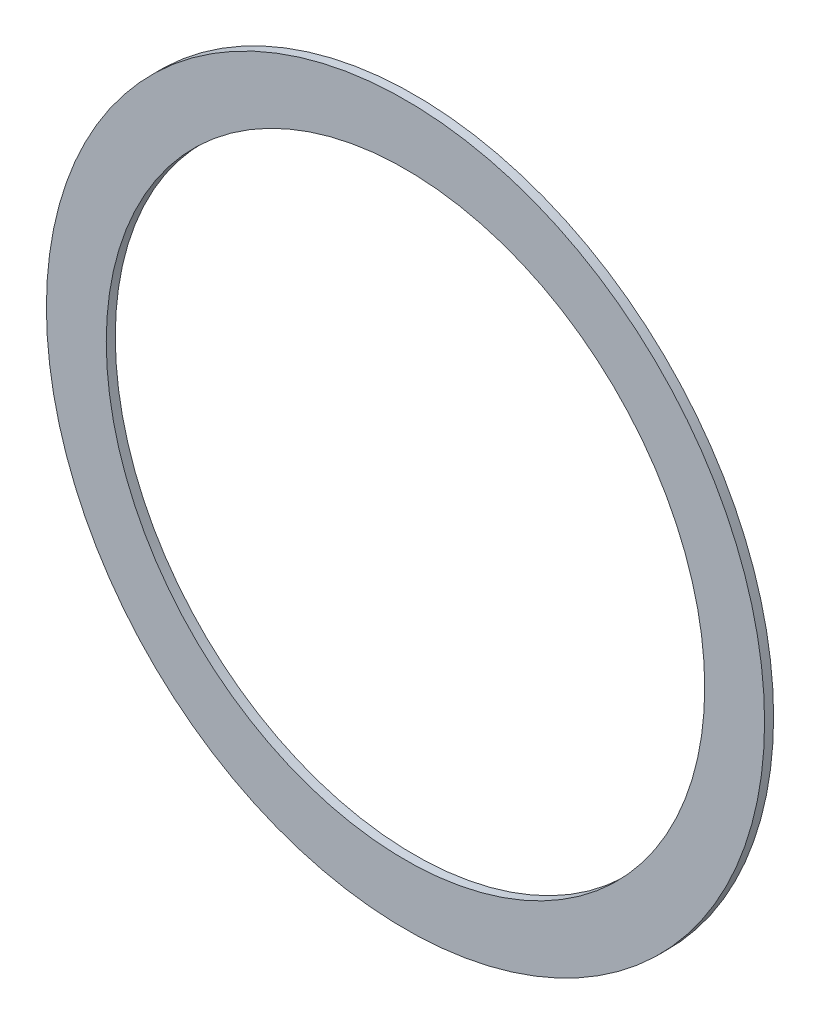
ISO-10303-21;
HEADER;
FILE_DESCRIPTION(('STEP AP214'),'2;1');
FILE_NAME('part.step','',(''),(''),'','','');
FILE_SCHEMA(('AUTOMOTIVE_DESIGN { 1 0 10303 214 1 1 1 1 }'));
ENDSEC;
DATA;
#1=APPLICATION_CONTEXT('core data for automotive mechanical design processes');
#2=APPLICATION_PROTOCOL_DEFINITION('international standard','automotive_design',2000,#1);
#3=PRODUCT_CONTEXT('',#1,'mechanical');
#4=PRODUCT('Part','Part','',(#3));
#5=PRODUCT_RELATED_PRODUCT_CATEGORY('part','',(#4));
#6=PRODUCT_DEFINITION_FORMATION('','',#4);
#7=PRODUCT_DEFINITION_CONTEXT('part definition',#1,'design');
#8=PRODUCT_DEFINITION('design','',#6,#7);
#9=PRODUCT_DEFINITION_SHAPE('','',#8);
#10=(LENGTH_UNIT() NAMED_UNIT(*) SI_UNIT(.MILLI.,.METRE.));
#11=(NAMED_UNIT(*) PLANE_ANGLE_UNIT() SI_UNIT($,.RADIAN.));
#12=(NAMED_UNIT(*) SI_UNIT($,.STERADIAN.) SOLID_ANGLE_UNIT());
#13=UNCERTAINTY_MEASURE_WITH_UNIT(LENGTH_MEASURE(1.E-05),#10,'distance_accuracy_value','');
#14=(GEOMETRIC_REPRESENTATION_CONTEXT(3) GLOBAL_UNCERTAINTY_ASSIGNED_CONTEXT((#13)) GLOBAL_UNIT_ASSIGNED_CONTEXT((#10,
#11,#12)) REPRESENTATION_CONTEXT('',''));
#15=CARTESIAN_POINT('',(0.,0.,0.));
#16=DIRECTION('',(0.,0.,1.));
#17=DIRECTION('',(1.,0.,0.));
#18=AXIS2_PLACEMENT_3D('',#15,#16,#17);
#19=CARTESIAN_POINT('',(0.,0.,0.3175));
#20=DIRECTION('',(0.,0.,1.));
#21=DIRECTION('',(1.,0.,0.));
#22=AXIS2_PLACEMENT_3D('',#19,#20,#21);
#23=PLANE('',#22);
#24=CARTESIAN_POINT('',(0.,0.,0.3175));
#25=DIRECTION('',(0.,0.,1.));
#26=DIRECTION('',(1.,0.,0.));
#27=AXIS2_PLACEMENT_3D('',#24,#25,#26);
#28=CIRCLE('',#27,12.6492);
#29=CARTESIAN_POINT('',(12.6492,0.,0.3175));
#30=VERTEX_POINT('',#29);
#31=EDGE_CURVE('E10',#30,#30,#28,.T.);
#32=ORIENTED_EDGE('',*,*,#31,.T.);
#33=EDGE_LOOP('',(#32));
#34=FACE_BOUND('',#33,.T.);
#35=CARTESIAN_POINT('',(0.,0.,0.3175));
#36=DIRECTION('',(0.,0.,1.));
#37=DIRECTION('',(1.,0.,0.));
#38=AXIS2_PLACEMENT_3D('',#35,#36,#37);
#39=CIRCLE('',#38,10.541);
#40=CARTESIAN_POINT('',(10.541,0.,0.3175));
#41=VERTEX_POINT('',#40);
#42=EDGE_CURVE('E40',#41,#41,#39,.T.);
#43=ORIENTED_EDGE('',*,*,#42,.F.);
#44=EDGE_LOOP('',(#43));
#45=FACE_BOUND('',#44,.T.);
#46=ADVANCED_FACE('F29',(#34,#45),#23,.T.);
#47=CARTESIAN_POINT('',(0.,0.,0.));
#48=DIRECTION('',(0.,0.,1.));
#49=DIRECTION('',(1.,0.,0.));
#50=AXIS2_PLACEMENT_3D('',#47,#48,#49);
#51=PLANE('',#50);
#52=CARTESIAN_POINT('',(0.,0.,0.));
#53=DIRECTION('',(0.,0.,1.));
#54=DIRECTION('',(1.,0.,0.));
#55=AXIS2_PLACEMENT_3D('',#52,#53,#54);
#56=CIRCLE('',#55,12.6492);
#57=CARTESIAN_POINT('',(12.6492,0.,0.));
#58=VERTEX_POINT('',#57);
#59=EDGE_CURVE('E33',#58,#58,#56,.T.);
#60=ORIENTED_EDGE('',*,*,#59,.F.);
#61=EDGE_LOOP('',(#60));
#62=FACE_BOUND('',#61,.T.);
#63=CARTESIAN_POINT('',(0.,0.,0.));
#64=DIRECTION('',(0.,0.,1.));
#65=DIRECTION('',(1.,0.,0.));
#66=AXIS2_PLACEMENT_3D('',#63,#64,#65);
#67=CIRCLE('',#66,10.541);
#68=CARTESIAN_POINT('',(10.541,0.,0.));
#69=VERTEX_POINT('',#68);
#70=EDGE_CURVE('E42',#69,#69,#67,.T.);
#71=ORIENTED_EDGE('',*,*,#70,.T.);
#72=EDGE_LOOP('',(#71));
#73=FACE_BOUND('',#72,.T.);
#74=ADVANCED_FACE('F52',(#62,#73),#51,.F.);
#75=CARTESIAN_POINT('',(0.,0.,0.3175));
#76=DIRECTION('',(0.,0.,-1.));
#77=DIRECTION('',(-1.,0.,0.));
#78=AXIS2_PLACEMENT_3D('',#75,#76,#77);
#79=CYLINDRICAL_SURFACE('',#78,12.6492);
#80=ORIENTED_EDGE('',*,*,#31,.F.);
#81=EDGE_LOOP('',(#80));
#82=FACE_BOUND('',#81,.T.);
#83=ORIENTED_EDGE('',*,*,#59,.T.);
#84=EDGE_LOOP('',(#83));
#85=FACE_BOUND('',#84,.T.);
#86=ADVANCED_FACE('F31',(#82,#85),#79,.T.);
#87=CARTESIAN_POINT('',(0.,0.,0.3175));
#88=DIRECTION('',(0.,0.,-1.));
#89=DIRECTION('',(-1.,0.,0.));
#90=AXIS2_PLACEMENT_3D('',#87,#88,#89);
#91=CYLINDRICAL_SURFACE('',#90,10.541);
#92=ORIENTED_EDGE('',*,*,#42,.T.);
#93=EDGE_LOOP('',(#92));
#94=FACE_BOUND('',#93,.T.);
#95=ORIENTED_EDGE('',*,*,#70,.F.);
#96=EDGE_LOOP('',(#95));
#97=FACE_BOUND('',#96,.T.);
#98=ADVANCED_FACE('F48',(#94,#97),#91,.F.);
#99=CLOSED_SHELL('',(#46,#74,#86,#98));
#100=MANIFOLD_SOLID_BREP('B2',#99);
#101=ADVANCED_BREP_SHAPE_REPRESENTATION('',(#18,#100),#14);
#102=SHAPE_DEFINITION_REPRESENTATION(#9,#101);
ENDSEC;
END-ISO-10303-21;
